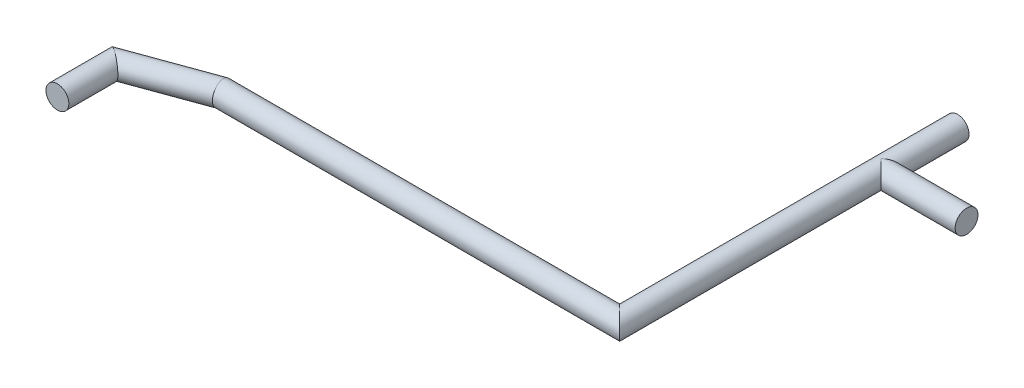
ISO-10303-21;
HEADER;
FILE_DESCRIPTION(('STEP AP214'),'2;1');
FILE_NAME('part.step','',(''),(''),'','','');
FILE_SCHEMA(('AUTOMOTIVE_DESIGN { 1 0 10303 214 1 1 1 1 }'));
ENDSEC;
DATA;
#1=APPLICATION_CONTEXT('core data for automotive mechanical design processes');
#2=APPLICATION_PROTOCOL_DEFINITION('international standard','automotive_design',2000,#1);
#3=PRODUCT_CONTEXT('',#1,'mechanical');
#4=PRODUCT('Part','Part','',(#3));
#5=PRODUCT_RELATED_PRODUCT_CATEGORY('part','',(#4));
#6=PRODUCT_DEFINITION_FORMATION('','',#4);
#7=PRODUCT_DEFINITION_CONTEXT('part definition',#1,'design');
#8=PRODUCT_DEFINITION('design','',#6,#7);
#9=PRODUCT_DEFINITION_SHAPE('','',#8);
#10=(LENGTH_UNIT() NAMED_UNIT(*) SI_UNIT(.MILLI.,.METRE.));
#11=(NAMED_UNIT(*) PLANE_ANGLE_UNIT() SI_UNIT($,.RADIAN.));
#12=(NAMED_UNIT(*) SI_UNIT($,.STERADIAN.) SOLID_ANGLE_UNIT());
#13=UNCERTAINTY_MEASURE_WITH_UNIT(LENGTH_MEASURE(1.E-05),#10,'distance_accuracy_value','');
#14=(GEOMETRIC_REPRESENTATION_CONTEXT(3) GLOBAL_UNCERTAINTY_ASSIGNED_CONTEXT((#13)) GLOBAL_UNIT_ASSIGNED_CONTEXT((#10,
#11,#12)) REPRESENTATION_CONTEXT('',''));
#15=CARTESIAN_POINT('',(0.,0.,0.));
#16=DIRECTION('',(0.,0.,1.));
#17=DIRECTION('',(1.,0.,0.));
#18=AXIS2_PLACEMENT_3D('',#15,#16,#17);
#19=CARTESIAN_POINT('',(1.4875,0.,16.175));
#20=DIRECTION('',(1.,0.,0.));
#21=DIRECTION('',(0.,1.,0.));
#22=AXIS2_PLACEMENT_3D('',#19,#20,#21);
#23=PLANE('',#22);
#24=CARTESIAN_POINT('',(1.4875,0.,16.175));
#25=DIRECTION('',(1.,0.,0.));
#26=DIRECTION('',(0.,0.,-1.));
#27=AXIS2_PLACEMENT_3D('',#24,#25,#26);
#28=CIRCLE('',#27,0.175);
#29=CARTESIAN_POINT('',(1.4875,0.,16.));
#30=VERTEX_POINT('',#29);
#31=EDGE_CURVE('E20',#30,#30,#28,.F.);
#32=ORIENTED_EDGE('',*,*,#31,.F.);
#33=EDGE_LOOP('',(#32));
#34=FACE_BOUND('',#33,.T.);
#35=ADVANCED_FACE('F16',(#34),#23,.T.);
#36=CARTESIAN_POINT('',(-7.125,0.,21.4875));
#37=DIRECTION('',(0.,0.,1.));
#38=DIRECTION('',(1.,0.,0.));
#39=AXIS2_PLACEMENT_3D('',#36,#37,#38);
#40=PLANE('',#39);
#41=CARTESIAN_POINT('',(-7.125,0.,21.4875));
#42=DIRECTION('',(0.,0.,1.));
#43=DIRECTION('',(1.,0.,0.));
#44=AXIS2_PLACEMENT_3D('',#41,#42,#43);
#45=CIRCLE('',#44,0.175);
#46=CARTESIAN_POINT('',(-6.95,0.,21.4875));
#47=VERTEX_POINT('',#46);
#48=EDGE_CURVE('E37',#47,#47,#45,.F.);
#49=ORIENTED_EDGE('',*,*,#48,.F.);
#50=EDGE_LOOP('',(#49));
#51=FACE_BOUND('',#50,.T.);
#52=ADVANCED_FACE('F55',(#51),#40,.T.);
#53=CARTESIAN_POINT('',(0.83125,0.,16.175));
#54=DIRECTION('',(1.,0.,0.));
#55=DIRECTION('',(0.,0.,-1.));
#56=AXIS2_PLACEMENT_3D('',#53,#54,#55);
#57=CYLINDRICAL_SURFACE('',#56,0.175);
#58=ORIENTED_EDGE('',*,*,#31,.T.);
#59=EDGE_LOOP('',(#58));
#60=FACE_BOUND('',#59,.T.);
#61=CARTESIAN_POINT('',(0.175,0.,16.175));
#62=DIRECTION('',(-0.707106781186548,0.,0.707106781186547));
#63=DIRECTION('',(0.707106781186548,0.,0.707106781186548));
#64=AXIS2_PLACEMENT_3D('',#61,#62,#63);
#65=ELLIPSE('',#64,0.247487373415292,0.175);
#66=CARTESIAN_POINT('',(0.175,-0.175,16.175));
#67=VERTEX_POINT('',#66);
#68=CARTESIAN_POINT('',(0.175,0.175,16.175));
#69=VERTEX_POINT('',#68);
#70=EDGE_CURVE('E32',#67,#69,#65,.T.);
#71=ORIENTED_EDGE('',*,*,#70,.F.);
#72=CARTESIAN_POINT('',(0.175,0.,16.175));
#73=DIRECTION('',(0.707106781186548,0.,0.707106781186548));
#74=DIRECTION('',(0.707106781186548,0.,-0.707106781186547));
#75=AXIS2_PLACEMENT_3D('',#72,#73,#74);
#76=ELLIPSE('',#75,0.247487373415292,0.175);
#77=EDGE_CURVE('E34',#69,#67,#76,.F.);
#78=ORIENTED_EDGE('',*,*,#77,.F.);
#79=EDGE_LOOP('',(#71,#78));
#80=FACE_BOUND('',#79,.T.);
#81=ADVANCED_FACE('F35',(#60,#80),#57,.T.);
#82=CARTESIAN_POINT('',(0.175,0.,15.));
#83=DIRECTION('',(0.,0.,-1.));
#84=DIRECTION('',(-1.,0.,0.));
#85=AXIS2_PLACEMENT_3D('',#82,#83,#84);
#86=PLANE('',#85);
#87=CARTESIAN_POINT('',(0.175,0.,15.));
#88=DIRECTION('',(0.,0.,1.));
#89=DIRECTION('',(1.,0.,0.));
#90=AXIS2_PLACEMENT_3D('',#87,#88,#89);
#91=CIRCLE('',#90,0.175);
#92=CARTESIAN_POINT('',(0.35,0.,15.));
#93=VERTEX_POINT('',#92);
#94=EDGE_CURVE('E41',#93,#93,#91,.T.);
#95=ORIENTED_EDGE('',*,*,#94,.F.);
#96=EDGE_LOOP('',(#95));
#97=FACE_BOUND('',#96,.T.);
#98=ADVANCED_FACE('F81',(#97),#86,.T.);
#99=CARTESIAN_POINT('',(-7.125,0.,20.9894299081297));
#100=DIRECTION('',(0.,0.,1.));
#101=DIRECTION('',(1.,0.,0.));
#102=AXIS2_PLACEMENT_3D('',#99,#100,#101);
#103=CYLINDRICAL_SURFACE('',#102,0.175);
#104=ORIENTED_EDGE('',*,*,#48,.T.);
#105=EDGE_LOOP('',(#104));
#106=FACE_BOUND('',#105,.T.);
#107=CARTESIAN_POINT('',(-7.125,0.,20.6138961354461));
#108=DIRECTION('',(0.573576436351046,0.,-0.819152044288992));
#109=DIRECTION('',(0.819152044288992,0.,0.573576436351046));
#110=AXIS2_PLACEMENT_3D('',#107,#108,#109);
#111=ELLIPSE('',#110,0.213635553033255,0.175);
#112=CARTESIAN_POINT('',(-6.95,0.,20.7364324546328));
#113=VERTEX_POINT('',#112);
#114=EDGE_CURVE('E44',#113,#113,#111,.T.);
#115=ORIENTED_EDGE('',*,*,#114,.F.);
#116=EDGE_LOOP('',(#115));
#117=FACE_BOUND('',#116,.T.);
#118=ADVANCED_FACE('F79',(#106,#117),#103,.T.);
#119=CARTESIAN_POINT('',(0.175,0.,17.675));
#120=DIRECTION('',(0.,0.,1.));
#121=DIRECTION('',(1.,0.,0.));
#122=AXIS2_PLACEMENT_3D('',#119,#120,#121);
#123=CYLINDRICAL_SURFACE('',#122,0.175);
#124=ORIENTED_EDGE('',*,*,#70,.T.);
#125=ORIENTED_EDGE('',*,*,#77,.T.);
#126=EDGE_LOOP('',(#124,#125));
#127=FACE_BOUND('',#126,.T.);
#128=CARTESIAN_POINT('',(0.175,0.,20.175));
#129=DIRECTION('',(0.707106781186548,0.,-0.707106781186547));
#130=DIRECTION('',(0.707106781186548,0.,0.707106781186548));
#131=AXIS2_PLACEMENT_3D('',#128,#129,#130);
#132=ELLIPSE('',#131,0.247487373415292,0.175);
#133=CARTESIAN_POINT('',(0.35,0.,20.35));
#134=VERTEX_POINT('',#133);
#135=EDGE_CURVE('E26',#134,#134,#132,.F.);
#136=ORIENTED_EDGE('',*,*,#135,.F.);
#137=EDGE_LOOP('',(#136));
#138=FACE_BOUND('',#137,.T.);
#139=ORIENTED_EDGE('',*,*,#94,.T.);
#140=EDGE_LOOP('',(#139));
#141=FACE_BOUND('',#140,.T.);
#142=ADVANCED_FACE('F39',(#127,#138,#141),#123,.T.);
#143=CARTESIAN_POINT('',(-6.56514647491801,0.,20.4101261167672));
#144=DIRECTION('',(0.939692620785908,0.,-0.342020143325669));
#145=DIRECTION('',(-0.342020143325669,0.,-0.939692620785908));
#146=AXIS2_PLACEMENT_3D('',#143,#144,#145);
#147=CYLINDRICAL_SURFACE('',#146,0.175);
#148=CARTESIAN_POINT('',(-5.91914277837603,0.,20.175));
#149=DIRECTION('',(0.984807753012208,0.,-0.17364817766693));
#150=DIRECTION('',(0.17364817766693,0.,0.984807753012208));
#151=AXIS2_PLACEMENT_3D('',#148,#149,#150);
#152=ELLIPSE('',#151,0.177699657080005,0.175);
#153=CARTESIAN_POINT('',(-5.88828555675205,0.,20.35));
#154=VERTEX_POINT('',#153);
#155=EDGE_CURVE('E10',#154,#154,#152,.T.);
#156=ORIENTED_EDGE('',*,*,#155,.F.);
#157=EDGE_LOOP('',(#156));
#158=FACE_BOUND('',#157,.T.);
#159=ORIENTED_EDGE('',*,*,#114,.T.);
#160=EDGE_LOOP('',(#159));
#161=FACE_BOUND('',#160,.T.);
#162=ADVANCED_FACE('F64',(#158,#161),#147,.T.);
#163=CARTESIAN_POINT('',(-2.8,0.,20.175));
#164=DIRECTION('',(1.,0.,0.));
#165=DIRECTION('',(0.,0.,-1.));
#166=AXIS2_PLACEMENT_3D('',#163,#164,#165);
#167=CYLINDRICAL_SURFACE('',#166,0.175);
#168=ORIENTED_EDGE('',*,*,#155,.T.);
#169=EDGE_LOOP('',(#168));
#170=FACE_BOUND('',#169,.T.);
#171=ORIENTED_EDGE('',*,*,#135,.T.);
#172=EDGE_LOOP('',(#171));
#173=FACE_BOUND('',#172,.T.);
#174=ADVANCED_FACE('F18',(#170,#173),#167,.T.);
#175=CLOSED_SHELL('',(#35,#52,#81,#98,#118,#142,#162,#174));
#176=MANIFOLD_SOLID_BREP('B1',#175);
#177=ADVANCED_BREP_SHAPE_REPRESENTATION('',(#18,#176),#14);
#178=SHAPE_DEFINITION_REPRESENTATION(#9,#177);
ENDSEC;
END-ISO-10303-21;
